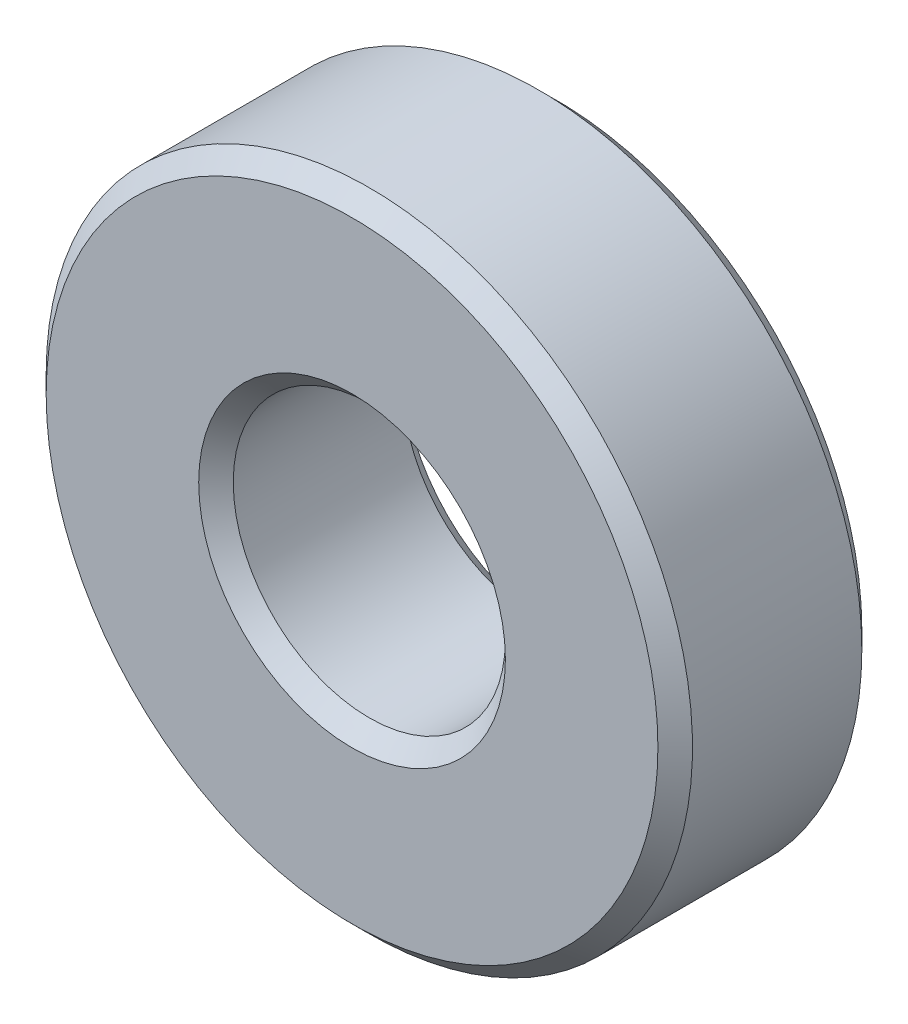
from build123d import *

# Parameters (mm, degrees)
SKETCH1_R           = 9.5
SKETCH1_R_2         = 4
BOSS_EXTRUDE1_DEPTH = 5.9944
CHAMFER1_SIZE       = 0.508


with BuildPart() as part:
    # Sketch1 → Boss-Extrude1 (new body)
    with BuildSketch(Plane.XY):
        with Locations(Location((0, 0, 0), (0, 0, 180))):
            Circle(SKETCH1_R)
        with Locations(Location((0, 0, 0), (0, 0, 180))):
            Circle(SKETCH1_R_2, mode=Mode.SUBTRACT)
    extrude(amount=BOSS_EXTRUDE1_DEPTH)

    # Chamfer1
    chamfer1_edges = [part.edges().sort_by_distance(p)[0] for p in [
        (9.5, 0, 0),
        (9.5, 0, 5.9944),
        (4, 0, 0),
        (4, 0, 5.9944),
    ]]
    chamfer(chamfer1_edges, length=CHAMFER1_SIZE)


solid = part.part
